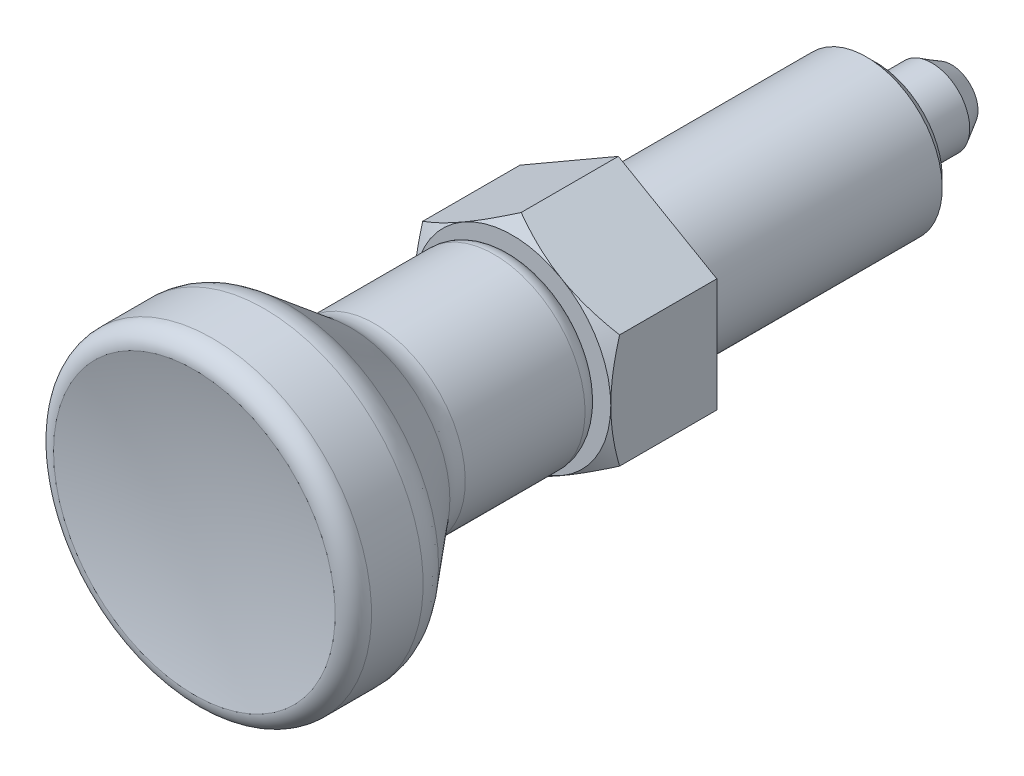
ISO-10303-21;
HEADER;
FILE_DESCRIPTION(('STEP AP214'),'2;1');
FILE_NAME('part.step','',(''),(''),'','','');
FILE_SCHEMA(('AUTOMOTIVE_DESIGN { 1 0 10303 214 1 1 1 1 }'));
ENDSEC;
DATA;
#1=APPLICATION_CONTEXT('core data for automotive mechanical design processes');
#2=APPLICATION_PROTOCOL_DEFINITION('international standard','automotive_design',2000,#1);
#3=PRODUCT_CONTEXT('',#1,'mechanical');
#4=PRODUCT('Part','Part','',(#3));
#5=PRODUCT_RELATED_PRODUCT_CATEGORY('part','',(#4));
#6=PRODUCT_DEFINITION_FORMATION('','',#4);
#7=PRODUCT_DEFINITION_CONTEXT('part definition',#1,'design');
#8=PRODUCT_DEFINITION('design','',#6,#7);
#9=PRODUCT_DEFINITION_SHAPE('','',#8);
#10=(LENGTH_UNIT() NAMED_UNIT(*) SI_UNIT(.MILLI.,.METRE.));
#11=(NAMED_UNIT(*) PLANE_ANGLE_UNIT() SI_UNIT($,.RADIAN.));
#12=(NAMED_UNIT(*) SI_UNIT($,.STERADIAN.) SOLID_ANGLE_UNIT());
#13=UNCERTAINTY_MEASURE_WITH_UNIT(LENGTH_MEASURE(1.E-05),#10,'distance_accuracy_value','');
#14=(GEOMETRIC_REPRESENTATION_CONTEXT(3) GLOBAL_UNCERTAINTY_ASSIGNED_CONTEXT((#13)) GLOBAL_UNIT_ASSIGNED_CONTEXT((#10,
#11,#12)) REPRESENTATION_CONTEXT('',''));
#15=CARTESIAN_POINT('',(0.,0.,0.));
#16=DIRECTION('',(0.,0.,1.));
#17=DIRECTION('',(1.,0.,0.));
#18=AXIS2_PLACEMENT_3D('',#15,#16,#17);
#19=CARTESIAN_POINT('',(0.,0.,5.2679491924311));
#20=DIRECTION('',(0.,0.,-1.));
#21=DIRECTION('',(0.,1.,0.));
#22=AXIS2_PLACEMENT_3D('',#19,#20,#21);
#23=CONICAL_SURFACE('',#22,9.5,1.04719755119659);
#24=CARTESIAN_POINT('',(-6.5,10.1135208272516,3.81175608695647));
#25=CARTESIAN_POINT('',(-6.5,9.82935034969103,3.94973702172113));
#26=CARTESIAN_POINT('',(-6.5,9.54453109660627,4.08640451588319));
#27=CARTESIAN_POINT('',(-6.5,8.97325017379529,4.35637460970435));
#28=CARTESIAN_POINT('',(-6.5,8.68678825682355,4.48967668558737));
#29=CARTESIAN_POINT('',(-6.5,8.11041696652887,4.75284152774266));
#30=CARTESIAN_POINT('',(-6.5,7.8204973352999,4.88268190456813));
#31=CARTESIAN_POINT('',(-6.5,7.23836377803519,5.13709346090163));
#32=CARTESIAN_POINT('',(-6.5,6.94614996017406,5.26166488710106));
#33=CARTESIAN_POINT('',(-6.5,6.34939053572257,5.50810187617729));
#34=CARTESIAN_POINT('',(-6.5,6.04475338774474,5.62974696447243));
#35=CARTESIAN_POINT('',(-6.5,5.43192693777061,5.86391042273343));
#36=CARTESIAN_POINT('',(-6.5,5.12373724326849,5.97642777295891));
#37=CARTESIAN_POINT('',(-6.5,4.50388286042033,6.18940644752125));
#38=CARTESIAN_POINT('',(-6.5,4.19222654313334,6.28989189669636));
#39=CARTESIAN_POINT('',(-6.5,3.56443984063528,6.47560299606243));
#40=CARTESIAN_POINT('',(-6.5,3.2483108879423,6.56083341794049));
#41=CARTESIAN_POINT('',(-6.5,2.61318438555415,6.7115124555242));
#42=CARTESIAN_POINT('',(-6.5,2.29421310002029,6.77707001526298));
#43=CARTESIAN_POINT('',(-6.5,1.65222382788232,6.88470964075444));
#44=CARTESIAN_POINT('',(-6.5,1.32920623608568,6.92679397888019));
#45=CARTESIAN_POINT('',(-6.5,0.845079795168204,6.96952256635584));
#46=CARTESIAN_POINT('',(-6.5,0.684830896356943,6.98035981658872));
#47=CARTESIAN_POINT('',(-6.5,0.364011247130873,6.99525189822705));
#48=CARTESIAN_POINT('',(-6.5,0.203440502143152,6.99930684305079));
#49=CARTESIAN_POINT('',(-6.5,-0.117726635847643,7.00053001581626));
#50=CARTESIAN_POINT('',(-6.5,-0.278323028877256,6.99769823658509));
#51=CARTESIAN_POINT('',(-6.5,-0.599253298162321,6.98521963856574));
#52=CARTESIAN_POINT('',(-6.5,-0.759587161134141,6.97557248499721));
#53=CARTESIAN_POINT('',(-6.5,-1.14392607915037,6.94448274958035));
#54=CARTESIAN_POINT('',(-6.5,-1.36767946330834,6.91986134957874));
#55=CARTESIAN_POINT('',(-6.5,-1.81353669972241,6.85868030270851));
#56=CARTESIAN_POINT('',(-6.5,-2.03564032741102,6.82211905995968));
#57=CARTESIAN_POINT('',(-6.5,-2.69921711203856,6.69646317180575));
#58=CARTESIAN_POINT('',(-6.5,-3.13771059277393,6.59141887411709));
#59=CARTESIAN_POINT('',(-6.5,-3.79339853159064,6.40912052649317));
#60=CARTESIAN_POINT('',(-6.5,-4.01399055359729,6.34338257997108));
#61=CARTESIAN_POINT('',(-6.5,-4.4530325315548,6.20504191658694));
#62=CARTESIAN_POINT('',(-6.5,-4.67148247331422,6.13243915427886));
#63=CARTESIAN_POINT('',(-6.5,-5.10630803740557,5.98153678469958));
#64=CARTESIAN_POINT('',(-6.5,-5.32268430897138,5.90323903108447));
#65=CARTESIAN_POINT('',(-6.5,-5.75364187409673,5.74187158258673));
#66=CARTESIAN_POINT('',(-6.5,-5.96822318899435,5.65880194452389));
#67=CARTESIAN_POINT('',(-6.5,-6.47567680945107,5.45689655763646));
#68=CARTESIAN_POINT('',(-6.5,-6.76784492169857,5.33629419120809));
#69=CARTESIAN_POINT('',(-6.5,-7.34967886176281,5.08917991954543));
#70=CARTESIAN_POINT('',(-6.5,-7.6393445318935,4.96266764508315));
#71=CARTESIAN_POINT('',(-6.5,-8.21663477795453,4.7049231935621));
#72=CARTESIAN_POINT('',(-6.5,-8.5042589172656,4.57369004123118));
#73=CARTESIAN_POINT('',(-6.5,-9.07775904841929,4.30745118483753));
#74=CARTESIAN_POINT('',(-6.5,-9.36363500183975,4.17244539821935));
#75=CARTESIAN_POINT('',(-6.5,-9.93423055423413,3.8992253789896));
#76=CARTESIAN_POINT('',(-6.5,-10.2189485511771,3.76100780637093));
#77=CARTESIAN_POINT('',(-6.5,-10.7871485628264,3.48205273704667));
#78=CARTESIAN_POINT('',(-6.5,-11.0706305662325,3.34131521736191));
#79=CARTESIAN_POINT('',(-6.5,-11.9194411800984,2.91603342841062));
#80=CARTESIAN_POINT('',(-6.5,-12.4832128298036,2.6283820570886));
#81=CARTESIAN_POINT('',(-6.5,-13.5602729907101,2.07178894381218));
#82=CARTESIAN_POINT('',(-6.5,-14.0738056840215,1.80331758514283));
#83=CARTESIAN_POINT('',(-6.5,-15.0989534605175,1.26269618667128));
#84=CARTESIAN_POINT('',(-6.5,-15.6105684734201,0.990546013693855));
#85=CARTESIAN_POINT('',(-6.5,-16.6310038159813,0.444141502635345));
#86=CARTESIAN_POINT('',(-6.5,-17.1398279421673,0.169894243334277));
#87=CARTESIAN_POINT('',(-6.5,-18.1562506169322,-0.38079503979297));
#88=CARTESIAN_POINT('',(-6.5,-18.6638492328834,-0.657236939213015));
#89=CARTESIAN_POINT('',(-6.5,-19.170997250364,-0.934497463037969));
#90=B_SPLINE_CURVE_WITH_KNOTS('',3,(#24,#25,#26,#27,#28,#29,#30,#31,#32,#33,#34,#35,#36,#37,#38,
#39,#40,#41,#42,#43,#44,#45,#46,#47,#48,#49,#50,#51,#52,#53,#54,#55,#56,#57,#58,#59,#60,#61,#62,
#63,#64,#65,#66,#67,#68,#69,#70,#71,#72,#73,#74,#75,#76,#77,#78,#79,#80,#81,#82,#83,#84,#85,#86,
#87,#88,#89),.UNSPECIFIED.,.F.,.F.,(4,2,2,2,2,2,2,2,2,2,2,2,2,2,2,2,2,2,2,2,2,2,2,2,2,2,2,2,2,2,
2,2,4),(0.,0.947705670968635,1.89555793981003,2.84851502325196,3.80142743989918,
4.78539370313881,5.7694697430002,6.7515383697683,7.73329927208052,8.7095185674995,
9.68564334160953,10.1673664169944,10.6490814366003,11.1307969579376,11.612536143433,
12.2874673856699,12.9624888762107,14.3132683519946,15.0037467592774,15.694229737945,
16.3844889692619,17.0747399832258,18.0228948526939,18.9711090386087,19.919520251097,
20.8679522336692,21.8174190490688,22.7668945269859,24.6655842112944,26.4039970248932,
28.1424729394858,29.8765439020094,31.6105172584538),.UNSPECIFIED.);
#91=CARTESIAN_POINT('',(-6.5,-3.7527767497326,6.41944341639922));
#92=VERTEX_POINT('',#91);
#93=CARTESIAN_POINT('',(-6.5,0.,7.));
#94=VERTEX_POINT('',#93);
#95=EDGE_CURVE('E9',#92,#94,#90,.F.);
#96=ORIENTED_EDGE('',*,*,#95,.F.);
#97=CARTESIAN_POINT('',(0.000200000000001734,-7.50566896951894,6.41937674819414));
#98=CARTESIAN_POINT('',(-0.142677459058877,-7.42317863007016,6.46699557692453));
#99=CARTESIAN_POINT('',(-0.286087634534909,-7.34038072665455,6.51245329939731));
#100=CARTESIAN_POINT('',(-0.574072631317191,-7.17411251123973,6.59845131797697));
#101=CARTESIAN_POINT('',(-0.718647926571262,-7.09064192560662,6.63898949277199));
#102=CARTESIAN_POINT('',(-1.15468865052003,-6.83889369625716,6.75242899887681));
#103=CARTESIAN_POINT('',(-1.44787528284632,-6.66962231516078,6.81695219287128));
#104=CARTESIAN_POINT('',(-1.88662374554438,-6.41631077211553,6.89261341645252));
#105=CARTESIAN_POINT('',(-2.03087463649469,-6.33302748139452,6.91416714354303));
#106=CARTESIAN_POINT('',(-2.32002821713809,-6.16608458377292,6.95030968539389));
#107=CARTESIAN_POINT('',(-2.46493084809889,-6.08242501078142,6.96489911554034));
#108=CARTESIAN_POINT('',(-2.75498777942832,-5.91496056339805,6.98674124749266));
#109=CARTESIAN_POINT('',(-2.90014160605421,-5.83115596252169,6.9940022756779));
#110=CARTESIAN_POINT('',(-3.19057533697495,-5.66347396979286,7.00103969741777));
#111=CARTESIAN_POINT('',(-3.33585523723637,-5.5795965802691,7.00081632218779));
#112=CARTESIAN_POINT('',(-3.7338759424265,-5.34979921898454,6.98991654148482));
#113=CARTESIAN_POINT('',(-3.98648646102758,-5.20395446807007,6.97161818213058));
#114=CARTESIAN_POINT('',(-4.49002967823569,-4.91323365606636,6.91359365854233));
#115=CARTESIAN_POINT('',(-4.74096060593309,-4.76835861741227,6.87384766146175));
#116=CARTESIAN_POINT('',(-5.24551722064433,-4.47705272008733,6.77449409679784));
#117=CARTESIAN_POINT('',(-5.49907924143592,-4.33065861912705,6.71446557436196));
#118=CARTESIAN_POINT('',(-6.00242193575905,-4.04005357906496,6.57822500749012));
#119=CARTESIAN_POINT('',(-6.25220905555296,-3.89583891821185,6.50204496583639));
#120=CARTESIAN_POINT('',(-6.5002,-3.75266127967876,6.41937674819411));
#121=B_SPLINE_CURVE_WITH_KNOTS('',3,(#97,#98,#99,#100,#101,#102,#103,#104,#105,#106,#107,#108,
#109,#110,#111,#112,#113,#114,#115,#116,#117,#118,#119,#120),.UNSPECIFIED.,.F.,.F.,(4,2,2,2,2,2,
2,2,2,2,2,4),(0.,0.515105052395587,1.03043143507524,2.06322554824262,2.56697389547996,
3.07067772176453,3.57380860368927,4.0769239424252,4.95279354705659,5.82947446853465,
6.72559912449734,7.61996451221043),.UNSPECIFIED.);
#122=CARTESIAN_POINT('',(-3.24999999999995,-5.62916512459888,7.));
#123=VERTEX_POINT('',#122);
#124=EDGE_CURVE('E204',#123,#92,#121,.T.);
#125=ORIENTED_EDGE('',*,*,#124,.F.);
#126=CARTESIAN_POINT('',(0.,0.,7.));
#127=DIRECTION('',(0.,0.,1.));
#128=DIRECTION('',(0.,-1.,0.));
#129=AXIS2_PLACEMENT_3D('',#126,#127,#128);
#130=CIRCLE('',#129,6.5);
#131=EDGE_CURVE('E262',#94,#123,#130,.T.);
#132=ORIENTED_EDGE('',*,*,#131,.F.);
#133=EDGE_LOOP('',(#96,#125,#132));
#134=FACE_BOUND('',#133,.T.);
#135=ADVANCED_FACE('F14',(#134),#23,.T.);
#136=CARTESIAN_POINT('',(-6.5,3.7527767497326,6.41944341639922));
#137=VERTEX_POINT('',#136);
#138=EDGE_CURVE('E18',#94,#137,#90,.F.);
#139=ORIENTED_EDGE('',*,*,#138,.F.);
#140=CARTESIAN_POINT('',(-3.24999999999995,5.62916512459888,7.));
#141=VERTEX_POINT('',#140);
#142=EDGE_CURVE('E116',#141,#94,#130,.T.);
#143=ORIENTED_EDGE('',*,*,#142,.F.);
#144=CARTESIAN_POINT('',(-6.5002,3.75266127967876,6.41937674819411));
#145=CARTESIAN_POINT('',(-6.35732254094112,3.83515161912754,6.4669955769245));
#146=CARTESIAN_POINT('',(-6.21391236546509,3.91794952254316,6.51245329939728));
#147=CARTESIAN_POINT('',(-5.9259273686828,4.08421773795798,6.59845131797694));
#148=CARTESIAN_POINT('',(-5.78135207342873,4.16768832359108,6.63898949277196));
#149=CARTESIAN_POINT('',(-5.34531134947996,4.41943655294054,6.75242899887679));
#150=CARTESIAN_POINT('',(-5.05212471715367,4.58870793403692,6.81695219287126));
#151=CARTESIAN_POINT('',(-4.61337625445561,4.84201947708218,6.89261341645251));
#152=CARTESIAN_POINT('',(-4.46912536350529,4.92530276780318,6.91416714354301));
#153=CARTESIAN_POINT('',(-4.17997178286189,5.09224566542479,6.95030968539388));
#154=CARTESIAN_POINT('',(-4.03506915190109,5.17590523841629,6.96489911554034));
#155=CARTESIAN_POINT('',(-3.74501222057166,5.34336968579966,6.98674124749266));
#156=CARTESIAN_POINT('',(-3.59985839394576,5.42717428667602,6.9940022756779));
#157=CARTESIAN_POINT('',(-3.30942466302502,5.59485627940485,7.00103969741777));
#158=CARTESIAN_POINT('',(-3.16414476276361,5.67873366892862,7.0008163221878));
#159=CARTESIAN_POINT('',(-2.76612405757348,5.90853103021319,6.98991654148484));
#160=CARTESIAN_POINT('',(-2.5135135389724,6.05437578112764,6.97161818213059));
#161=CARTESIAN_POINT('',(-2.0099703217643,6.34509659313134,6.91359365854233));
#162=CARTESIAN_POINT('',(-1.7590393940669,6.48997163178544,6.87384766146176));
#163=CARTESIAN_POINT('',(-1.25448277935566,6.78127752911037,6.77449409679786));
#164=CARTESIAN_POINT('',(-1.00092075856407,6.92767163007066,6.71446557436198));
#165=CARTESIAN_POINT('',(-0.497578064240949,7.21827667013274,6.57822500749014));
#166=CARTESIAN_POINT('',(-0.247790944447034,7.36249133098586,6.50204496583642));
#167=CARTESIAN_POINT('',(0.000199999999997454,7.50566896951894,6.41937674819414));
#168=B_SPLINE_CURVE_WITH_KNOTS('',3,(#144,#145,#146,#147,#148,#149,#150,#151,#152,#153,#154,
#155,#156,#157,#158,#159,#160,#161,#162,#163,#164,#165,#166,#167),.UNSPECIFIED.,.F.,.F.,(4,2,2,
2,2,2,2,2,2,2,2,4),(0.,0.515105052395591,1.03043143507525,2.06322554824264,2.56697389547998,
3.07067772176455,3.5738086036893,4.07692394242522,4.95279354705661,5.82947446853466,
6.72559912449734,7.61996451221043),.UNSPECIFIED.);
#169=EDGE_CURVE('E265',#137,#141,#168,.T.);
#170=ORIENTED_EDGE('',*,*,#169,.F.);
#171=EDGE_LOOP('',(#139,#143,#170));
#172=FACE_BOUND('',#171,.T.);
#173=ADVANCED_FACE('F226',(#172),#23,.T.);
#174=CARTESIAN_POINT('',(0.,7.5055534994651,6.41944341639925));
#175=VERTEX_POINT('',#174);
#176=EDGE_CURVE('E112',#141,#175,#168,.T.);
#177=ORIENTED_EDGE('',*,*,#176,.F.);
#178=CARTESIAN_POINT('',(3.24999999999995,5.62916512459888,7.));
#179=VERTEX_POINT('',#178);
#180=EDGE_CURVE('E110',#179,#141,#130,.T.);
#181=ORIENTED_EDGE('',*,*,#180,.F.);
#182=CARTESIAN_POINT('',(-0.000200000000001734,7.50566896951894,6.41937674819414));
#183=CARTESIAN_POINT('',(0.142677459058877,7.42317863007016,6.46699557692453));
#184=CARTESIAN_POINT('',(0.286087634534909,7.34038072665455,6.51245329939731));
#185=CARTESIAN_POINT('',(0.574072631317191,7.17411251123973,6.59845131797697));
#186=CARTESIAN_POINT('',(0.718647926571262,7.09064192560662,6.63898949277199));
#187=CARTESIAN_POINT('',(1.15468865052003,6.83889369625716,6.75242899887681));
#188=CARTESIAN_POINT('',(1.44787528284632,6.66962231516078,6.81695219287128));
#189=CARTESIAN_POINT('',(1.88662374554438,6.41631077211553,6.89261341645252));
#190=CARTESIAN_POINT('',(2.03087463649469,6.33302748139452,6.91416714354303));
#191=CARTESIAN_POINT('',(2.32002821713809,6.16608458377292,6.95030968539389));
#192=CARTESIAN_POINT('',(2.46493084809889,6.08242501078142,6.96489911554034));
#193=CARTESIAN_POINT('',(2.75498777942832,5.91496056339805,6.98674124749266));
#194=CARTESIAN_POINT('',(2.90014160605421,5.83115596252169,6.9940022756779));
#195=CARTESIAN_POINT('',(3.19057533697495,5.66347396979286,7.00103969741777));
#196=CARTESIAN_POINT('',(3.33585523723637,5.5795965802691,7.00081632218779));
#197=CARTESIAN_POINT('',(3.7338759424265,5.34979921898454,6.98991654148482));
#198=CARTESIAN_POINT('',(3.98648646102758,5.20395446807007,6.97161818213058));
#199=CARTESIAN_POINT('',(4.49002967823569,4.91323365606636,6.91359365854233));
#200=CARTESIAN_POINT('',(4.74096060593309,4.76835861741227,6.87384766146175));
#201=CARTESIAN_POINT('',(5.24551722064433,4.47705272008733,6.77449409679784));
#202=CARTESIAN_POINT('',(5.49907924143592,4.33065861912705,6.71446557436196));
#203=CARTESIAN_POINT('',(6.00242193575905,4.04005357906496,6.57822500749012));
#204=CARTESIAN_POINT('',(6.25220905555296,3.89583891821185,6.50204496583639));
#205=CARTESIAN_POINT('',(6.5002,3.75266127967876,6.41937674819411));
#206=B_SPLINE_CURVE_WITH_KNOTS('',3,(#182,#183,#184,#185,#186,#187,#188,#189,#190,#191,#192,
#193,#194,#195,#196,#197,#198,#199,#200,#201,#202,#203,#204,#205),.UNSPECIFIED.,.F.,.F.,(4,2,2,
2,2,2,2,2,2,2,2,4),(0.,0.515105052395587,1.03043143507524,2.06322554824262,2.56697389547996,
3.07067772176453,3.57380860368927,4.0769239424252,4.95279354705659,5.82947446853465,
6.72559912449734,7.61996451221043),.UNSPECIFIED.);
#207=EDGE_CURVE('E90',#175,#179,#206,.T.);
#208=ORIENTED_EDGE('',*,*,#207,.F.);
#209=EDGE_LOOP('',(#177,#181,#208));
#210=FACE_BOUND('',#209,.T.);
#211=ADVANCED_FACE('F111',(#210),#23,.T.);
#212=CARTESIAN_POINT('',(0.,-7.5055534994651,6.41944341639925));
#213=VERTEX_POINT('',#212);
#214=EDGE_CURVE('E199',#213,#123,#121,.T.);
#215=ORIENTED_EDGE('',*,*,#214,.F.);
#216=CARTESIAN_POINT('',(6.5002,-3.75266127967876,6.41937674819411));
#217=CARTESIAN_POINT('',(6.35732254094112,-3.83515161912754,6.4669955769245));
#218=CARTESIAN_POINT('',(6.21391236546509,-3.91794952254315,6.51245329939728));
#219=CARTESIAN_POINT('',(5.9259273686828,-4.08421773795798,6.59845131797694));
#220=CARTESIAN_POINT('',(5.78135207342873,-4.16768832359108,6.63898949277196));
#221=CARTESIAN_POINT('',(5.34531134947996,-4.41943655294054,6.75242899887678));
#222=CARTESIAN_POINT('',(5.05212471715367,-4.58870793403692,6.81695219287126));
#223=CARTESIAN_POINT('',(4.61337625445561,-4.84201947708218,6.89261341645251));
#224=CARTESIAN_POINT('',(4.46912536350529,-4.92530276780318,6.91416714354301));
#225=CARTESIAN_POINT('',(4.17997178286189,-5.09224566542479,6.95030968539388));
#226=CARTESIAN_POINT('',(4.03506915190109,-5.17590523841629,6.96489911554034));
#227=CARTESIAN_POINT('',(3.74501222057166,-5.34336968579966,6.98674124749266));
#228=CARTESIAN_POINT('',(3.59985839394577,-5.42717428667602,6.9940022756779));
#229=CARTESIAN_POINT('',(3.30942466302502,-5.59485627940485,7.00103969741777));
#230=CARTESIAN_POINT('',(3.16414476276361,-5.67873366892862,7.0008163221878));
#231=CARTESIAN_POINT('',(2.76612405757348,-5.90853103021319,6.98991654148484));
#232=CARTESIAN_POINT('',(2.5135135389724,-6.05437578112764,6.97161818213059));
#233=CARTESIAN_POINT('',(2.0099703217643,-6.34509659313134,6.91359365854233));
#234=CARTESIAN_POINT('',(1.7590393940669,-6.48997163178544,6.87384766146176));
#235=CARTESIAN_POINT('',(1.25448277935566,-6.78127752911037,6.77449409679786));
#236=CARTESIAN_POINT('',(1.00092075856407,-6.92767163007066,6.71446557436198));
#237=CARTESIAN_POINT('',(0.497578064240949,-7.21827667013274,6.57822500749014));
#238=CARTESIAN_POINT('',(0.247790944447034,-7.36249133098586,6.50204496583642));
#239=CARTESIAN_POINT('',(-0.000199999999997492,-7.50566896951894,6.41937674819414));
#240=B_SPLINE_CURVE_WITH_KNOTS('',3,(#216,#217,#218,#219,#220,#221,#222,#223,#224,#225,#226,
#227,#228,#229,#230,#231,#232,#233,#234,#235,#236,#237,#238,#239),.UNSPECIFIED.,.F.,.F.,(4,2,2,
2,2,2,2,2,2,2,2,4),(0.,0.515105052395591,1.03043143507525,2.06322554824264,2.56697389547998,
3.07067772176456,3.5738086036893,4.07692394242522,4.95279354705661,5.82947446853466,
6.72559912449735,7.61996451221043),.UNSPECIFIED.);
#241=CARTESIAN_POINT('',(3.24999999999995,-5.62916512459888,7.));
#242=VERTEX_POINT('',#241);
#243=EDGE_CURVE('E100',#242,#213,#240,.T.);
#244=ORIENTED_EDGE('',*,*,#243,.F.);
#245=EDGE_CURVE('E123',#123,#242,#130,.T.);
#246=ORIENTED_EDGE('',*,*,#245,.F.);
#247=EDGE_LOOP('',(#215,#244,#246));
#248=FACE_BOUND('',#247,.T.);
#249=ADVANCED_FACE('F244',(#248),#23,.T.);
#250=CARTESIAN_POINT('',(6.5,3.7527767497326,6.41944341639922));
#251=VERTEX_POINT('',#250);
#252=EDGE_CURVE('E94',#179,#251,#206,.T.);
#253=ORIENTED_EDGE('',*,*,#252,.F.);
#254=CARTESIAN_POINT('',(6.5,0.,7.));
#255=VERTEX_POINT('',#254);
#256=EDGE_CURVE('E106',#255,#179,#130,.T.);
#257=ORIENTED_EDGE('',*,*,#256,.F.);
#258=CARTESIAN_POINT('',(6.5,10.1135208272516,3.81175608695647));
#259=CARTESIAN_POINT('',(6.5,9.82935034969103,3.94973702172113));
#260=CARTESIAN_POINT('',(6.5,9.54453109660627,4.08640451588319));
#261=CARTESIAN_POINT('',(6.5,8.97325017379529,4.35637460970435));
#262=CARTESIAN_POINT('',(6.5,8.68678825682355,4.48967668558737));
#263=CARTESIAN_POINT('',(6.5,8.11041696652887,4.75284152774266));
#264=CARTESIAN_POINT('',(6.5,7.8204973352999,4.88268190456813));
#265=CARTESIAN_POINT('',(6.5,7.23836377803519,5.13709346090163));
#266=CARTESIAN_POINT('',(6.5,6.94614996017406,5.26166488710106));
#267=CARTESIAN_POINT('',(6.5,6.34939053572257,5.50810187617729));
#268=CARTESIAN_POINT('',(6.5,6.04475338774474,5.62974696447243));
#269=CARTESIAN_POINT('',(6.5,5.43192693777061,5.86391042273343));
#270=CARTESIAN_POINT('',(6.5,5.12373724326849,5.97642777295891));
#271=CARTESIAN_POINT('',(6.5,4.50388286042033,6.18940644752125));
#272=CARTESIAN_POINT('',(6.5,4.19222654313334,6.28989189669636));
#273=CARTESIAN_POINT('',(6.5,3.56443984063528,6.47560299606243));
#274=CARTESIAN_POINT('',(6.5,3.2483108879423,6.56083341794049));
#275=CARTESIAN_POINT('',(6.5,2.61318438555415,6.7115124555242));
#276=CARTESIAN_POINT('',(6.5,2.29421310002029,6.77707001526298));
#277=CARTESIAN_POINT('',(6.5,1.65222382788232,6.88470964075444));
#278=CARTESIAN_POINT('',(6.5,1.32920623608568,6.92679397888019));
#279=CARTESIAN_POINT('',(6.5,0.845079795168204,6.96952256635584));
#280=CARTESIAN_POINT('',(6.5,0.684830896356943,6.98035981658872));
#281=CARTESIAN_POINT('',(6.5,0.364011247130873,6.99525189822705));
#282=CARTESIAN_POINT('',(6.5,0.203440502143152,6.99930684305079));
#283=CARTESIAN_POINT('',(6.5,-0.117726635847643,7.00053001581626));
#284=CARTESIAN_POINT('',(6.5,-0.278323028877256,6.99769823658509));
#285=CARTESIAN_POINT('',(6.5,-0.599253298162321,6.98521963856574));
#286=CARTESIAN_POINT('',(6.5,-0.759587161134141,6.97557248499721));
#287=CARTESIAN_POINT('',(6.5,-1.14392607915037,6.94448274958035));
#288=CARTESIAN_POINT('',(6.5,-1.36767946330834,6.91986134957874));
#289=CARTESIAN_POINT('',(6.5,-1.81353669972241,6.85868030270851));
#290=CARTESIAN_POINT('',(6.5,-2.03564032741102,6.82211905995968));
#291=CARTESIAN_POINT('',(6.5,-2.69921711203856,6.69646317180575));
#292=CARTESIAN_POINT('',(6.5,-3.13771059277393,6.59141887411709));
#293=CARTESIAN_POINT('',(6.5,-3.79339853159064,6.40912052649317));
#294=CARTESIAN_POINT('',(6.5,-4.01399055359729,6.34338257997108));
#295=CARTESIAN_POINT('',(6.5,-4.4530325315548,6.20504191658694));
#296=CARTESIAN_POINT('',(6.5,-4.67148247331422,6.13243915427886));
#297=CARTESIAN_POINT('',(6.5,-5.10630803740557,5.98153678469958));
#298=CARTESIAN_POINT('',(6.5,-5.32268430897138,5.90323903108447));
#299=CARTESIAN_POINT('',(6.5,-5.75364187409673,5.74187158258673));
#300=CARTESIAN_POINT('',(6.5,-5.96822318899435,5.65880194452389));
#301=CARTESIAN_POINT('',(6.5,-6.47567680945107,5.45689655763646));
#302=CARTESIAN_POINT('',(6.5,-6.76784492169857,5.33629419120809));
#303=CARTESIAN_POINT('',(6.5,-7.34967886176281,5.08917991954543));
#304=CARTESIAN_POINT('',(6.5,-7.6393445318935,4.96266764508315));
#305=CARTESIAN_POINT('',(6.5,-8.21663477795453,4.7049231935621));
#306=CARTESIAN_POINT('',(6.5,-8.5042589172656,4.57369004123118));
#307=CARTESIAN_POINT('',(6.5,-9.07775904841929,4.30745118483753));
#308=CARTESIAN_POINT('',(6.5,-9.36363500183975,4.17244539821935));
#309=CARTESIAN_POINT('',(6.5,-9.93423055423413,3.8992253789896));
#310=CARTESIAN_POINT('',(6.5,-10.2189485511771,3.76100780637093));
#311=CARTESIAN_POINT('',(6.5,-10.7871485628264,3.48205273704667));
#312=CARTESIAN_POINT('',(6.5,-11.0706305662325,3.34131521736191));
#313=CARTESIAN_POINT('',(6.5,-11.9194411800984,2.91603342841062));
#314=CARTESIAN_POINT('',(6.5,-12.4832128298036,2.6283820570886));
#315=CARTESIAN_POINT('',(6.5,-13.5602729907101,2.07178894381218));
#316=CARTESIAN_POINT('',(6.5,-14.0738056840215,1.80331758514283));
#317=CARTESIAN_POINT('',(6.5,-15.0989534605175,1.26269618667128));
#318=CARTESIAN_POINT('',(6.5,-15.6105684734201,0.990546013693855));
#319=CARTESIAN_POINT('',(6.5,-16.6310038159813,0.444141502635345));
#320=CARTESIAN_POINT('',(6.5,-17.1398279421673,0.169894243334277));
#321=CARTESIAN_POINT('',(6.5,-18.1562506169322,-0.38079503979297));
#322=CARTESIAN_POINT('',(6.5,-18.6638492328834,-0.657236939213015));
#323=CARTESIAN_POINT('',(6.5,-19.170997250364,-0.934497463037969));
#324=B_SPLINE_CURVE_WITH_KNOTS('',3,(#258,#259,#260,#261,#262,#263,#264,#265,#266,#267,#268,
#269,#270,#271,#272,#273,#274,#275,#276,#277,#278,#279,#280,#281,#282,#283,#284,#285,#286,#287,
#288,#289,#290,#291,#292,#293,#294,#295,#296,#297,#298,#299,#300,#301,#302,#303,#304,#305,#306,
#307,#308,#309,#310,#311,#312,#313,#314,#315,#316,#317,#318,#319,#320,#321,#322,#323),
.UNSPECIFIED.,.F.,.F.,(4,2,2,2,2,2,2,2,2,2,2,2,2,2,2,2,2,2,2,2,2,2,2,2,2,2,2,2,2,2,2,2,4),(0.,
0.947705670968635,1.89555793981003,2.84851502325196,3.80142743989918,4.78539370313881,
5.7694697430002,6.7515383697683,7.73329927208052,8.7095185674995,9.68564334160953,
10.1673664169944,10.6490814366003,11.1307969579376,11.612536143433,12.2874673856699,
12.9624888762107,14.3132683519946,15.0037467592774,15.694229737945,16.3844889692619,
17.0747399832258,18.0228948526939,18.9711090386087,19.919520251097,20.8679522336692,
21.8174190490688,22.7668945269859,24.6655842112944,26.4039970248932,28.1424729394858,
29.8765439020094,31.6105172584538),.UNSPECIFIED.);
#325=EDGE_CURVE('E41',#251,#255,#324,.T.);
#326=ORIENTED_EDGE('',*,*,#325,.F.);
#327=EDGE_LOOP('',(#253,#257,#326));
#328=FACE_BOUND('',#327,.T.);
#329=ADVANCED_FACE('F104',(#328),#23,.T.);
#330=CARTESIAN_POINT('',(6.5,-3.7527767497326,6.41944341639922));
#331=VERTEX_POINT('',#330);
#332=EDGE_CURVE('E108',#331,#242,#240,.T.);
#333=ORIENTED_EDGE('',*,*,#332,.F.);
#334=EDGE_CURVE('E169',#255,#331,#324,.T.);
#335=ORIENTED_EDGE('',*,*,#334,.F.);
#336=EDGE_CURVE('E121',#242,#255,#130,.T.);
#337=ORIENTED_EDGE('',*,*,#336,.F.);
#338=EDGE_LOOP('',(#333,#335,#337));
#339=FACE_BOUND('',#338,.T.);
#340=ADVANCED_FACE('F228',(#339),#23,.T.);
#341=CARTESIAN_POINT('',(9.93042453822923E-12,0.,68.9574169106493));
#342=DIRECTION('',(0.,0.,1.));
#343=DIRECTION('',(-1.,0.,0.));
#344=AXIS2_PLACEMENT_3D('',#341,#342,#343);
#345=SPHERICAL_SURFACE('',#344,41.9999999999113);
#346=CARTESIAN_POINT('',(0.,0.,28.));
#347=DIRECTION('',(0.,0.,1.));
#348=DIRECTION('',(0.,-1.,0.));
#349=AXIS2_PLACEMENT_3D('',#346,#347,#348);
#350=CIRCLE('',#349,9.29999999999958);
#351=CARTESIAN_POINT('',(0.,-9.29999999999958,28.));
#352=VERTEX_POINT('',#351);
#353=EDGE_CURVE('E166',#352,#352,#350,.T.);
#354=ORIENTED_EDGE('',*,*,#353,.T.);
#355=EDGE_LOOP('',(#354));
#356=FACE_BOUND('',#355,.T.);
#357=ADVANCED_FACE('F16',(#356),#345,.F.);
#358=CARTESIAN_POINT('',(0.,0.,26.8000000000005));
#359=DIRECTION('',(0.,0.,1.));
#360=DIRECTION('',(0.,-1.,0.));
#361=AXIS2_PLACEMENT_3D('',#358,#359,#360);
#362=TOROIDAL_SURFACE('',#361,9.30000000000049,1.19999999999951);
#363=CARTESIAN_POINT('',(0.,0.,26.8));
#364=DIRECTION('',(0.,0.,1.));
#365=DIRECTION('',(0.,-1.,0.));
#366=AXIS2_PLACEMENT_3D('',#363,#364,#365);
#367=CIRCLE('',#366,10.5);
#368=CARTESIAN_POINT('',(0.,-10.5,26.8));
#369=VERTEX_POINT('',#368);
#370=EDGE_CURVE('E163',#369,#369,#367,.T.);
#371=ORIENTED_EDGE('',*,*,#370,.T.);
#372=EDGE_LOOP('',(#371));
#373=FACE_BOUND('',#372,.T.);
#374=ORIENTED_EDGE('',*,*,#353,.F.);
#375=EDGE_LOOP('',(#374));
#376=FACE_BOUND('',#375,.T.);
#377=ADVANCED_FACE('F242',(#373,#376),#362,.T.);
#378=CARTESIAN_POINT('',(0.,0.,-93.));
#379=DIRECTION('',(0.,0.,1.));
#380=DIRECTION('',(0.,-1.,0.));
#381=AXIS2_PLACEMENT_3D('',#378,#379,#380);
#382=CYLINDRICAL_SURFACE('',#381,10.5);
#383=CARTESIAN_POINT('',(0.,0.,23.392408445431));
#384=DIRECTION('',(0.,0.,1.));
#385=DIRECTION('',(0.,-1.,0.));
#386=AXIS2_PLACEMENT_3D('',#383,#384,#385);
#387=CIRCLE('',#386,10.5);
#388=CARTESIAN_POINT('',(0.,-10.5,23.392408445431));
#389=VERTEX_POINT('',#388);
#390=EDGE_CURVE('E160',#389,#389,#387,.T.);
#391=ORIENTED_EDGE('',*,*,#390,.T.);
#392=EDGE_LOOP('',(#391));
#393=FACE_BOUND('',#392,.T.);
#394=ORIENTED_EDGE('',*,*,#370,.F.);
#395=EDGE_LOOP('',(#394));
#396=FACE_BOUND('',#395,.T.);
#397=ADVANCED_FACE('F343',(#393,#396),#382,.T.);
#398=CARTESIAN_POINT('',(0.,0.,23.3924084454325));
#399=DIRECTION('',(0.,0.,1.));
#400=DIRECTION('',(0.,-1.,0.));
#401=AXIS2_PLACEMENT_3D('',#398,#399,#400);
#402=TOROIDAL_SURFACE('',#401,7.99999999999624,2.50000000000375);
#403=CARTESIAN_POINT('',(0.,0.,21.809313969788));
#404=DIRECTION('',(0.,0.,1.));
#405=DIRECTION('',(0.,-1.,0.));
#406=AXIS2_PLACEMENT_3D('',#403,#404,#405);
#407=CIRCLE('',#406,9.9348932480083);
#408=CARTESIAN_POINT('',(0.,-9.9348932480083,21.809313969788));
#409=VERTEX_POINT('',#408);
#410=EDGE_CURVE('E157',#409,#409,#407,.T.);
#411=ORIENTED_EDGE('',*,*,#410,.T.);
#412=EDGE_LOOP('',(#411));
#413=FACE_BOUND('',#412,.T.);
#414=ORIENTED_EDGE('',*,*,#390,.F.);
#415=EDGE_LOOP('',(#414));
#416=FACE_BOUND('',#415,.T.);
#417=ADVANCED_FACE('F339',(#413,#416),#402,.T.);
#418=CARTESIAN_POINT('',(0.,0.,21.809313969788));
#419=DIRECTION('',(0.,0.,1.));
#420=DIRECTION('',(0.,-1.,0.));
#421=AXIS2_PLACEMENT_3D('',#418,#419,#420);
#422=CONICAL_SURFACE('',#421,9.9348932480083,0.685729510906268);
#423=CARTESIAN_POINT('',(0.,0.,17.690686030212));
#424=DIRECTION('',(0.,0.,1.));
#425=DIRECTION('',(0.,-1.,0.));
#426=AXIS2_PLACEMENT_3D('',#423,#424,#425);
#427=CIRCLE('',#426,6.5651067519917);
#428=CARTESIAN_POINT('',(0.,-6.5651067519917,17.690686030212));
#429=VERTEX_POINT('',#428);
#430=EDGE_CURVE('E154',#429,#429,#427,.T.);
#431=ORIENTED_EDGE('',*,*,#430,.T.);
#432=EDGE_LOOP('',(#431));
#433=FACE_BOUND('',#432,.T.);
#434=ORIENTED_EDGE('',*,*,#410,.F.);
#435=EDGE_LOOP('',(#434));
#436=FACE_BOUND('',#435,.T.);
#437=ADVANCED_FACE('F335',(#433,#436),#422,.T.);
#438=CARTESIAN_POINT('',(0.,0.,16.1075915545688));
#439=DIRECTION('',(0.,0.,1.));
#440=DIRECTION('',(0.,-1.,0.));
#441=AXIS2_PLACEMENT_3D('',#438,#439,#440);
#442=TOROIDAL_SURFACE('',#441,8.5,2.50000000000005);
#443=CARTESIAN_POINT('',(0.,0.,16.1075915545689));
#444=DIRECTION('',(0.,0.,1.));
#445=DIRECTION('',(0.,-1.,0.));
#446=AXIS2_PLACEMENT_3D('',#443,#444,#445);
#447=CIRCLE('',#446,6.);
#448=CARTESIAN_POINT('',(0.,-6.,16.1075915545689));
#449=VERTEX_POINT('',#448);
#450=EDGE_CURVE('E151',#449,#449,#447,.T.);
#451=ORIENTED_EDGE('',*,*,#450,.T.);
#452=EDGE_LOOP('',(#451));
#453=FACE_BOUND('',#452,.T.);
#454=ORIENTED_EDGE('',*,*,#430,.F.);
#455=EDGE_LOOP('',(#454));
#456=FACE_BOUND('',#455,.T.);
#457=ADVANCED_FACE('F331',(#453,#456),#442,.F.);
#458=CARTESIAN_POINT('',(0.,0.,-93.));
#459=DIRECTION('',(0.,0.,1.));
#460=DIRECTION('',(0.,-1.,0.));
#461=AXIS2_PLACEMENT_3D('',#458,#459,#460);
#462=CYLINDRICAL_SURFACE('',#461,6.);
#463=CARTESIAN_POINT('',(0.,0.,8.2));
#464=DIRECTION('',(0.,0.,1.));
#465=DIRECTION('',(0.,-1.,0.));
#466=AXIS2_PLACEMENT_3D('',#463,#464,#465);
#467=CIRCLE('',#466,6.);
#468=CARTESIAN_POINT('',(0.,-6.,8.2));
#469=VERTEX_POINT('',#468);
#470=EDGE_CURVE('E148',#469,#469,#467,.T.);
#471=ORIENTED_EDGE('',*,*,#470,.T.);
#472=EDGE_LOOP('',(#471));
#473=FACE_BOUND('',#472,.T.);
#474=ORIENTED_EDGE('',*,*,#450,.F.);
#475=EDGE_LOOP('',(#474));
#476=FACE_BOUND('',#475,.T.);
#477=ADVANCED_FACE('F327',(#473,#476),#462,.T.);
#478=CARTESIAN_POINT('',(0.,0.,8.2));
#479=DIRECTION('',(0.,0.,1.));
#480=DIRECTION('',(0.,-1.,0.));
#481=AXIS2_PLACEMENT_3D('',#478,#479,#480);
#482=TOROIDAL_SURFACE('',#481,4.80000000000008,1.19999999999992);
#483=CARTESIAN_POINT('',(0.,0.,7.));
#484=DIRECTION('',(0.,0.,1.));
#485=DIRECTION('',(0.,-1.,0.));
#486=AXIS2_PLACEMENT_3D('',#483,#484,#485);
#487=CIRCLE('',#486,4.8);
#488=CARTESIAN_POINT('',(0.,-4.8,7.));
#489=VERTEX_POINT('',#488);
#490=EDGE_CURVE('E145',#489,#489,#487,.T.);
#491=ORIENTED_EDGE('',*,*,#490,.T.);
#492=EDGE_LOOP('',(#491));
#493=FACE_BOUND('',#492,.T.);
#494=ORIENTED_EDGE('',*,*,#470,.F.);
#495=EDGE_LOOP('',(#494));
#496=FACE_BOUND('',#495,.T.);
#497=ADVANCED_FACE('F313',(#493,#496),#482,.T.);
#498=CARTESIAN_POINT('',(6.5,0.,7.));
#499=DIRECTION('',(0.,0.,-1.));
#500=DIRECTION('',(0.,1.,0.));
#501=AXIS2_PLACEMENT_3D('',#498,#499,#500);
#502=PLANE('',#501);
#503=ORIENTED_EDGE('',*,*,#490,.F.);
#504=EDGE_LOOP('',(#503));
#505=FACE_BOUND('',#504,.T.);
#506=ORIENTED_EDGE('',*,*,#336,.T.);
#507=ORIENTED_EDGE('',*,*,#256,.T.);
#508=ORIENTED_EDGE('',*,*,#180,.T.);
#509=ORIENTED_EDGE('',*,*,#142,.T.);
#510=ORIENTED_EDGE('',*,*,#131,.T.);
#511=ORIENTED_EDGE('',*,*,#245,.T.);
#512=EDGE_LOOP('',(#506,#507,#508,#509,#510,#511));
#513=FACE_BOUND('',#512,.T.);
#514=ADVANCED_FACE('F118',(#505,#513),#502,.F.);
#515=CARTESIAN_POINT('',(6.5,3.7527767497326,-2.));
#516=DIRECTION('',(0.499999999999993,0.866025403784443,0.));
#517=DIRECTION('',(-0.866025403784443,0.499999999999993,0.));
#518=AXIS2_PLACEMENT_3D('',#515,#516,#517);
#519=PLANE('',#518);
#520=DIRECTION('',(-0.866025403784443,0.499999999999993,0.));
#521=VECTOR('',#520,1.);
#522=CARTESIAN_POINT('',(7.,3.4641016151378,0.));
#523=LINE('',#522,#521);
#524=CARTESIAN_POINT('',(6.5,3.7527767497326,0.));
#525=VERTEX_POINT('',#524);
#526=CARTESIAN_POINT('',(0.,7.5055534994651,0.));
#527=VERTEX_POINT('',#526);
#528=EDGE_CURVE('E126',#525,#527,#523,.T.);
#529=ORIENTED_EDGE('',*,*,#528,.T.);
#530=DIRECTION('',(0.,0.,1.));
#531=VECTOR('',#530,1.);
#532=CARTESIAN_POINT('',(0.,7.5055534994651,-2.));
#533=LINE('',#532,#531);
#534=EDGE_CURVE('E96',#527,#175,#533,.T.);
#535=ORIENTED_EDGE('',*,*,#534,.T.);
#536=ORIENTED_EDGE('',*,*,#207,.T.);
#537=ORIENTED_EDGE('',*,*,#252,.T.);
#538=DIRECTION('',(0.,0.,1.));
#539=VECTOR('',#538,1.);
#540=CARTESIAN_POINT('',(6.5,3.7527767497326,-2.));
#541=LINE('',#540,#539);
#542=EDGE_CURVE('E286',#525,#251,#541,.T.);
#543=ORIENTED_EDGE('',*,*,#542,.F.);
#544=EDGE_LOOP('',(#529,#535,#536,#537,#543));
#545=FACE_BOUND('',#544,.T.);
#546=ADVANCED_FACE('F92',(#545),#519,.T.);
#547=CARTESIAN_POINT('',(0.,7.5055534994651,-2.));
#548=DIRECTION('',(-0.499999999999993,0.866025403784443,0.));
#549=DIRECTION('',(-0.866025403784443,-0.499999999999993,0.));
#550=AXIS2_PLACEMENT_3D('',#547,#548,#549);
#551=PLANE('',#550);
#552=DIRECTION('',(-0.866025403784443,-0.499999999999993,0.));
#553=VECTOR('',#552,1.);
#554=CARTESIAN_POINT('',(0.500000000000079,7.79422863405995,0.));
#555=LINE('',#554,#553);
#556=CARTESIAN_POINT('',(-6.5,3.7527767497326,0.));
#557=VERTEX_POINT('',#556);
#558=EDGE_CURVE('E269',#527,#557,#555,.T.);
#559=ORIENTED_EDGE('',*,*,#558,.T.);
#560=DIRECTION('',(0.,0.,1.));
#561=VECTOR('',#560,1.);
#562=CARTESIAN_POINT('',(-6.5,3.7527767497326,-2.));
#563=LINE('',#562,#561);
#564=EDGE_CURVE('E272',#557,#137,#563,.T.);
#565=ORIENTED_EDGE('',*,*,#564,.T.);
#566=ORIENTED_EDGE('',*,*,#169,.T.);
#567=ORIENTED_EDGE('',*,*,#176,.T.);
#568=ORIENTED_EDGE('',*,*,#534,.F.);
#569=EDGE_LOOP('',(#559,#565,#566,#567,#568));
#570=FACE_BOUND('',#569,.T.);
#571=ADVANCED_FACE('F193',(#570),#551,.T.);
#572=CARTESIAN_POINT('',(-6.5,3.7527767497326,-2.));
#573=DIRECTION('',(-1.,0.,0.));
#574=DIRECTION('',(0.,-1.,0.));
#575=AXIS2_PLACEMENT_3D('',#572,#573,#574);
#576=PLANE('',#575);
#577=DIRECTION('',(0.,-1.,0.));
#578=VECTOR('',#577,1.);
#579=CARTESIAN_POINT('',(-6.5,0.,0.));
#580=LINE('',#579,#578);
#581=CARTESIAN_POINT('',(-6.5,-3.7527767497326,0.));
#582=VERTEX_POINT('',#581);
#583=EDGE_CURVE('E279',#557,#582,#580,.T.);
#584=ORIENTED_EDGE('',*,*,#583,.T.);
#585=DIRECTION('',(0.,0.,1.));
#586=VECTOR('',#585,1.);
#587=CARTESIAN_POINT('',(-6.5,-3.7527767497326,-2.));
#588=LINE('',#587,#586);
#589=EDGE_CURVE('E259',#582,#92,#588,.T.);
#590=ORIENTED_EDGE('',*,*,#589,.T.);
#591=ORIENTED_EDGE('',*,*,#95,.T.);
#592=ORIENTED_EDGE('',*,*,#138,.T.);
#593=ORIENTED_EDGE('',*,*,#564,.F.);
#594=EDGE_LOOP('',(#584,#590,#591,#592,#593));
#595=FACE_BOUND('',#594,.T.);
#596=ADVANCED_FACE('F213',(#595),#576,.T.);
#597=CARTESIAN_POINT('',(-6.5,-3.7527767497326,-2.));
#598=DIRECTION('',(-0.499999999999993,-0.866025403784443,0.));
#599=DIRECTION('',(0.866025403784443,-0.499999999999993,0.));
#600=AXIS2_PLACEMENT_3D('',#597,#598,#599);
#601=PLANE('',#600);
#602=DIRECTION('',(0.866025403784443,-0.499999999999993,0.));
#603=VECTOR('',#602,1.);
#604=CARTESIAN_POINT('',(0.500000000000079,-7.79422863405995,0.));
#605=LINE('',#604,#603);
#606=CARTESIAN_POINT('',(0.,-7.5055534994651,0.));
#607=VERTEX_POINT('',#606);
#608=EDGE_CURVE('E258',#582,#607,#605,.T.);
#609=ORIENTED_EDGE('',*,*,#608,.T.);
#610=DIRECTION('',(0.,0.,1.));
#611=VECTOR('',#610,1.);
#612=CARTESIAN_POINT('',(0.,-7.5055534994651,-2.));
#613=LINE('',#612,#611);
#614=EDGE_CURVE('E250',#607,#213,#613,.T.);
#615=ORIENTED_EDGE('',*,*,#614,.T.);
#616=ORIENTED_EDGE('',*,*,#214,.T.);
#617=ORIENTED_EDGE('',*,*,#124,.T.);
#618=ORIENTED_EDGE('',*,*,#589,.F.);
#619=EDGE_LOOP('',(#609,#615,#616,#617,#618));
#620=FACE_BOUND('',#619,.T.);
#621=ADVANCED_FACE('F210',(#620),#601,.T.);
#622=CARTESIAN_POINT('',(0.,-7.5055534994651,-2.));
#623=DIRECTION('',(0.499999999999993,-0.866025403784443,0.));
#624=DIRECTION('',(0.866025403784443,0.499999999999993,0.));
#625=AXIS2_PLACEMENT_3D('',#622,#623,#624);
#626=PLANE('',#625);
#627=DIRECTION('',(0.866025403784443,0.499999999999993,0.));
#628=VECTOR('',#627,1.);
#629=CARTESIAN_POINT('',(7.,-3.4641016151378,0.));
#630=LINE('',#629,#628);
#631=CARTESIAN_POINT('',(6.5,-3.7527767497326,0.));
#632=VERTEX_POINT('',#631);
#633=EDGE_CURVE('E283',#607,#632,#630,.T.);
#634=ORIENTED_EDGE('',*,*,#633,.T.);
#635=DIRECTION('',(0.,0.,1.));
#636=VECTOR('',#635,1.);
#637=CARTESIAN_POINT('',(6.5,-3.7527767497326,-2.));
#638=LINE('',#637,#636);
#639=EDGE_CURVE('E35',#632,#331,#638,.T.);
#640=ORIENTED_EDGE('',*,*,#639,.T.);
#641=ORIENTED_EDGE('',*,*,#332,.T.);
#642=ORIENTED_EDGE('',*,*,#243,.T.);
#643=ORIENTED_EDGE('',*,*,#614,.F.);
#644=EDGE_LOOP('',(#634,#640,#641,#642,#643));
#645=FACE_BOUND('',#644,.T.);
#646=ADVANCED_FACE('F188',(#645),#626,.T.);
#647=CARTESIAN_POINT('',(6.5,-3.7527767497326,-2.));
#648=DIRECTION('',(1.,0.,0.));
#649=DIRECTION('',(0.,1.,0.));
#650=AXIS2_PLACEMENT_3D('',#647,#648,#649);
#651=PLANE('',#650);
#652=DIRECTION('',(0.,1.,0.));
#653=VECTOR('',#652,1.);
#654=CARTESIAN_POINT('',(6.5,0.,0.));
#655=LINE('',#654,#653);
#656=EDGE_CURVE('E271',#632,#525,#655,.T.);
#657=ORIENTED_EDGE('',*,*,#656,.T.);
#658=ORIENTED_EDGE('',*,*,#542,.T.);
#659=ORIENTED_EDGE('',*,*,#325,.T.);
#660=ORIENTED_EDGE('',*,*,#334,.T.);
#661=ORIENTED_EDGE('',*,*,#639,.F.);
#662=EDGE_LOOP('',(#657,#658,#659,#660,#661));
#663=FACE_BOUND('',#662,.T.);
#664=ADVANCED_FACE('F184',(#663),#651,.T.);
#665=CARTESIAN_POINT('',(1.7494446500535,0.,-22.));
#666=DIRECTION('',(0.,0.,-1.));
#667=DIRECTION('',(0.,1.,0.));
#668=AXIS2_PLACEMENT_3D('',#665,#666,#667);
#669=PLANE('',#668);
#670=CARTESIAN_POINT('',(0.,0.,-22.));
#671=DIRECTION('',(0.,0.,1.));
#672=DIRECTION('',(0.,-1.,0.));
#673=AXIS2_PLACEMENT_3D('',#670,#671,#672);
#674=CIRCLE('',#673,1.7494446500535);
#675=CARTESIAN_POINT('',(0.,-1.7494446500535,-22.));
#676=VERTEX_POINT('',#675);
#677=EDGE_CURVE('E139',#676,#676,#674,.T.);
#678=ORIENTED_EDGE('',*,*,#677,.F.);
#679=EDGE_LOOP('',(#678));
#680=FACE_BOUND('',#679,.T.);
#681=ADVANCED_FACE('F187',(#680),#669,.T.);
#682=CARTESIAN_POINT('',(0.,0.,-20.7));
#683=DIRECTION('',(0.,0.,1.));
#684=DIRECTION('',(0.,-1.,0.));
#685=AXIS2_PLACEMENT_3D('',#682,#683,#684);
#686=CONICAL_SURFACE('',#685,2.5,0.523598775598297);
#687=ORIENTED_EDGE('',*,*,#677,.T.);
#688=EDGE_LOOP('',(#687));
#689=FACE_BOUND('',#688,.T.);
#690=CARTESIAN_POINT('',(0.,0.,-20.7));
#691=DIRECTION('',(0.,0.,1.));
#692=DIRECTION('',(0.,-1.,0.));
#693=AXIS2_PLACEMENT_3D('',#690,#691,#692);
#694=CIRCLE('',#693,2.5);
#695=CARTESIAN_POINT('',(0.,-2.5,-20.7));
#696=VERTEX_POINT('',#695);
#697=EDGE_CURVE('E142',#696,#696,#694,.T.);
#698=ORIENTED_EDGE('',*,*,#697,.F.);
#699=EDGE_LOOP('',(#698));
#700=FACE_BOUND('',#699,.T.);
#701=ADVANCED_FACE('F317',(#689,#700),#686,.T.);
#702=CARTESIAN_POINT('',(0.,0.,-93.));
#703=DIRECTION('',(0.,0.,1.));
#704=DIRECTION('',(0.,-1.,0.));
#705=AXIS2_PLACEMENT_3D('',#702,#703,#704);
#706=CYLINDRICAL_SURFACE('',#705,2.5);
#707=ORIENTED_EDGE('',*,*,#697,.T.);
#708=EDGE_LOOP('',(#707));
#709=FACE_BOUND('',#708,.T.);
#710=CARTESIAN_POINT('',(0.,0.,-17.));
#711=DIRECTION('',(0.,0.,1.));
#712=DIRECTION('',(0.,-1.,0.));
#713=AXIS2_PLACEMENT_3D('',#710,#711,#712);
#714=CIRCLE('',#713,2.5);
#715=CARTESIAN_POINT('',(0.,-2.5,-17.));
#716=VERTEX_POINT('',#715);
#717=EDGE_CURVE('E136',#716,#716,#714,.T.);
#718=ORIENTED_EDGE('',*,*,#717,.F.);
#719=EDGE_LOOP('',(#718));
#720=FACE_BOUND('',#719,.T.);
#721=ADVANCED_FACE('F309',(#709,#720),#706,.T.);
#722=CARTESIAN_POINT('',(2.5,0.,-17.));
#723=DIRECTION('',(0.,0.,1.));
#724=DIRECTION('',(0.,-1.,0.));
#725=AXIS2_PLACEMENT_3D('',#722,#723,#724);
#726=PLANE('',#725);
#727=CARTESIAN_POINT('',(0.,0.,-17.));
#728=DIRECTION('',(0.,0.,1.));
#729=DIRECTION('',(0.,-1.,0.));
#730=AXIS2_PLACEMENT_3D('',#727,#728,#729);
#731=CIRCLE('',#730,4.3865);
#732=CARTESIAN_POINT('',(0.,-4.3865,-17.));
#733=VERTEX_POINT('',#732);
#734=EDGE_CURVE('E133',#733,#733,#731,.T.);
#735=ORIENTED_EDGE('',*,*,#734,.F.);
#736=EDGE_LOOP('',(#735));
#737=FACE_BOUND('',#736,.T.);
#738=ORIENTED_EDGE('',*,*,#717,.T.);
#739=EDGE_LOOP('',(#738));
#740=FACE_BOUND('',#739,.T.);
#741=ADVANCED_FACE('F305',(#737,#740),#726,.F.);
#742=CARTESIAN_POINT('',(0.,0.,-17.));
#743=DIRECTION('',(0.,0.,1.));
#744=DIRECTION('',(0.,-1.,0.));
#745=AXIS2_PLACEMENT_3D('',#742,#743,#744);
#746=CONICAL_SURFACE('',#745,4.3865,0.785398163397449);
#747=CARTESIAN_POINT('',(0.,0.,-16.3865));
#748=DIRECTION('',(0.,0.,1.));
#749=DIRECTION('',(0.,-1.,0.));
#750=AXIS2_PLACEMENT_3D('',#747,#748,#749);
#751=CIRCLE('',#750,5.);
#752=CARTESIAN_POINT('',(0.,-5.,-16.3865));
#753=VERTEX_POINT('',#752);
#754=EDGE_CURVE('E130',#753,#753,#751,.T.);
#755=ORIENTED_EDGE('',*,*,#754,.F.);
#756=EDGE_LOOP('',(#755));
#757=FACE_BOUND('',#756,.T.);
#758=ORIENTED_EDGE('',*,*,#734,.T.);
#759=EDGE_LOOP('',(#758));
#760=FACE_BOUND('',#759,.T.);
#761=ADVANCED_FACE('F299',(#757,#760),#746,.T.);
#762=CARTESIAN_POINT('',(0.,0.,-17.));
#763=DIRECTION('',(0.,0.,1.));
#764=DIRECTION('',(0.,-1.,0.));
#765=AXIS2_PLACEMENT_3D('',#762,#763,#764);
#766=CYLINDRICAL_SURFACE('',#765,5.);
#767=CARTESIAN_POINT('',(0.,0.,0.));
#768=DIRECTION('',(0.,0.,1.));
#769=DIRECTION('',(0.,-1.,0.));
#770=AXIS2_PLACEMENT_3D('',#767,#768,#769);
#771=CIRCLE('',#770,5.);
#772=CARTESIAN_POINT('',(0.,-5.,0.));
#773=VERTEX_POINT('',#772);
#774=EDGE_CURVE('E122',#773,#773,#771,.T.);
#775=ORIENTED_EDGE('',*,*,#774,.F.);
#776=EDGE_LOOP('',(#775));
#777=FACE_BOUND('',#776,.T.);
#778=ORIENTED_EDGE('',*,*,#754,.T.);
#779=EDGE_LOOP('',(#778));
#780=FACE_BOUND('',#779,.T.);
#781=ADVANCED_FACE('F292',(#777,#780),#766,.T.);
#782=CARTESIAN_POINT('',(5.,0.,0.));
#783=DIRECTION('',(0.,0.,1.));
#784=DIRECTION('',(0.,-1.,0.));
#785=AXIS2_PLACEMENT_3D('',#782,#783,#784);
#786=PLANE('',#785);
#787=ORIENTED_EDGE('',*,*,#774,.T.);
#788=EDGE_LOOP('',(#787));
#789=FACE_BOUND('',#788,.T.);
#790=ORIENTED_EDGE('',*,*,#528,.F.);
#791=ORIENTED_EDGE('',*,*,#656,.F.);
#792=ORIENTED_EDGE('',*,*,#633,.F.);
#793=ORIENTED_EDGE('',*,*,#608,.F.);
#794=ORIENTED_EDGE('',*,*,#583,.F.);
#795=ORIENTED_EDGE('',*,*,#558,.F.);
#796=EDGE_LOOP('',(#790,#791,#792,#793,#794,#795));
#797=FACE_BOUND('',#796,.T.);
#798=ADVANCED_FACE('F277',(#789,#797),#786,.F.);
#799=CLOSED_SHELL('',(#135,#173,#211,#249,#329,#340,#357,#377,#397,#417,#437,#457,#477,#497,
#514,#546,#571,#596,#621,#646,#664,#681,#701,#721,#741,#761,#781,#798));
#800=MANIFOLD_SOLID_BREP('B1',#799);
#801=ADVANCED_BREP_SHAPE_REPRESENTATION('',(#18,#800),#14);
#802=SHAPE_DEFINITION_REPRESENTATION(#9,#801);
ENDSEC;
END-ISO-10303-21;
